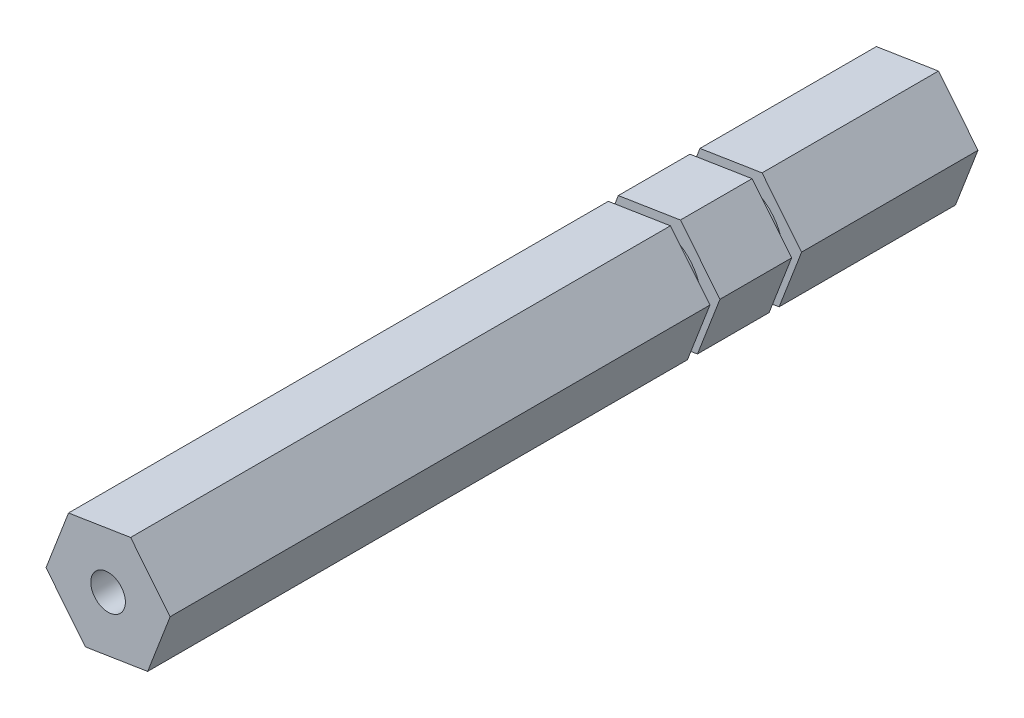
from build123d import *

# Parameters (mm, degrees)
BOSS_EXTRUDE1_DEPTH            = 94.234
SKETCH6_W                      = 1.1684
SKETCH6_H                      = 2.303148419
TAP_DRILL_FOR_10_32_TAP3_D     = 4.0386
TAP_DRILL_FOR_10_32_TAP3_DEPTH = 12.7
TAP_DRILL_FOR_10_32_TAP3_TIP   = 1.213317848


with BuildPart() as part:
    # Sketch1 → Boss-Extrude1 (new body)
    with BuildSketch(Plane.XY):
        Polygon((2.626799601, 6.845674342), (-4.615128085, 5.697712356), (-7.241927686, -1.147961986), (-2.626799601, -6.845674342), (4.615128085, -5.697712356), (7.241927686, 1.147961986), align=None)
    extrude(amount=BOSS_EXTRUDE1_DEPTH)

    # Sketch6 → Cut-Revolve1 (revolve, cut)
    with BuildSketch(Plane(origin=(0, 0, 0), x_dir=(0, 0, -1), z_dir=(0.7770651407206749, 0.6294201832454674, 0)), mode=Mode.PRIVATE) as cut_revolve1_sk:
        with Locations((-30.6832, 6.18077421)):
            Rectangle(SKETCH6_W, SKETCH6_H)
        with Locations((-21.1582, 6.18077421)):
            Rectangle(SKETCH6_W, SKETCH6_H)
    revolve(cut_revolve1_sk.sketch.rotate(Axis((0, 0, 0), (0, 0, 1)), 50.992642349), axis=Axis((0, 0, 0), (0, 0, 1)), mode=Mode.SUBTRACT)

    # Sketch9 → Tap Drill for _10-32 Tap2 (revolve, cut)
    with BuildSketch(Plane(origin=(0, 0, 94.234), x_dir=(0, -1, 0), z_dir=(1, 0, 0))):
        Polygon((0, 0), (0, 13.913317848), (2.0193, 12.7), (2.0193, 0), align=None)
    revolve(axis=Axis((0, 0, 100.584), (0, 0, -1)), mode=Mode.SUBTRACT)

    # Tap Drill for _10-32 Tap3
    with Locations(Plane(origin=(0, 0, 0), x_dir=(-1, 0, 0), z_dir=(0, 0, -1))):
        with Locations((0, 0)):
            Hole(TAP_DRILL_FOR_10_32_TAP3_D / 2, depth=TAP_DRILL_FOR_10_32_TAP3_DEPTH)
            with Locations((0, 0, -(TAP_DRILL_FOR_10_32_TAP3_DEPTH + TAP_DRILL_FOR_10_32_TAP3_TIP / 2))):  # 118° drill point
                Cone(0, TAP_DRILL_FOR_10_32_TAP3_D / 2, TAP_DRILL_FOR_10_32_TAP3_TIP, mode=Mode.SUBTRACT)


solid = part.part
